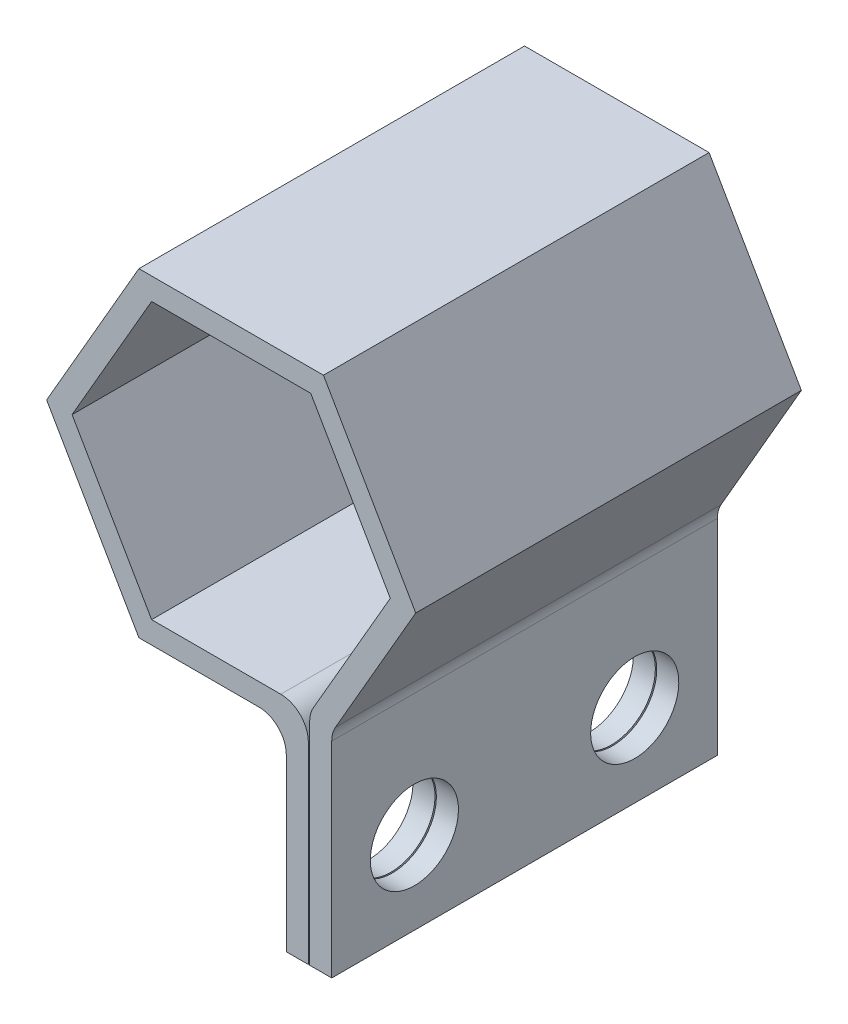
ISO-10303-21;
HEADER;
FILE_DESCRIPTION(('STEP AP214'),'2;1');
FILE_NAME('part.step','',(''),(''),'','','');
FILE_SCHEMA(('AUTOMOTIVE_DESIGN { 1 0 10303 214 1 1 1 1 }'));
ENDSEC;
DATA;
#1=APPLICATION_CONTEXT('core data for automotive mechanical design processes');
#2=APPLICATION_PROTOCOL_DEFINITION('international standard','automotive_design',2000,#1);
#3=PRODUCT_CONTEXT('',#1,'mechanical');
#4=PRODUCT('Part','Part','',(#3));
#5=PRODUCT_RELATED_PRODUCT_CATEGORY('part','',(#4));
#6=PRODUCT_DEFINITION_FORMATION('','',#4);
#7=PRODUCT_DEFINITION_CONTEXT('part definition',#1,'design');
#8=PRODUCT_DEFINITION('design','',#6,#7);
#9=PRODUCT_DEFINITION_SHAPE('','',#8);
#10=(LENGTH_UNIT() NAMED_UNIT(*) SI_UNIT(.MILLI.,.METRE.));
#11=(NAMED_UNIT(*) PLANE_ANGLE_UNIT() SI_UNIT($,.RADIAN.));
#12=(NAMED_UNIT(*) SI_UNIT($,.STERADIAN.) SOLID_ANGLE_UNIT());
#13=UNCERTAINTY_MEASURE_WITH_UNIT(LENGTH_MEASURE(1.E-05),#10,'distance_accuracy_value','');
#14=(GEOMETRIC_REPRESENTATION_CONTEXT(3) GLOBAL_UNCERTAINTY_ASSIGNED_CONTEXT((#13)) GLOBAL_UNIT_ASSIGNED_CONTEXT((#10,
#11,#12)) REPRESENTATION_CONTEXT('',''));
#15=CARTESIAN_POINT('',(0.,0.,0.));
#16=DIRECTION('',(0.,0.,1.));
#17=DIRECTION('',(1.,0.,0.));
#18=AXIS2_PLACEMENT_3D('',#15,#16,#17);
#19=CARTESIAN_POINT('',(2.88811978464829,5.00237020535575,14.));
#20=DIRECTION('',(0.,1.,0.));
#21=DIRECTION('',(0.,0.,1.));
#22=AXIS2_PLACEMENT_3D('',#19,#20,#21);
#23=PLANE('',#22);
#24=DIRECTION('',(1.,0.,0.));
#25=VECTOR('',#24,1.);
#26=CARTESIAN_POINT('',(2.88811978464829,5.00237020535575,0.));
#27=LINE('',#26,#25);
#28=CARTESIAN_POINT('',(-2.88811978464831,5.00237020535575,0.));
#29=VERTEX_POINT('',#28);
#30=CARTESIAN_POINT('',(2.88811978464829,5.00237020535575,0.));
#31=VERTEX_POINT('',#30);
#32=EDGE_CURVE('E225',#29,#31,#27,.T.);
#33=ORIENTED_EDGE('',*,*,#32,.T.);
#34=DIRECTION('',(0.,0.,-1.));
#35=VECTOR('',#34,1.);
#36=CARTESIAN_POINT('',(2.88811978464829,5.00237020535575,14.));
#37=LINE('',#36,#35);
#38=CARTESIAN_POINT('',(2.88811978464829,5.00237020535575,14.));
#39=VERTEX_POINT('',#38);
#40=EDGE_CURVE('E11',#39,#31,#37,.T.);
#41=ORIENTED_EDGE('',*,*,#40,.F.);
#42=DIRECTION('',(1.,0.,0.));
#43=VECTOR('',#42,1.);
#44=CARTESIAN_POINT('',(2.88811978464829,5.00237020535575,14.));
#45=LINE('',#44,#43);
#46=CARTESIAN_POINT('',(-2.88811978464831,5.00237020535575,14.));
#47=VERTEX_POINT('',#46);
#48=EDGE_CURVE('E290',#47,#39,#45,.T.);
#49=ORIENTED_EDGE('',*,*,#48,.F.);
#50=DIRECTION('',(0.,0.,-1.));
#51=VECTOR('',#50,1.);
#52=CARTESIAN_POINT('',(-2.88811978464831,5.00237020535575,14.));
#53=LINE('',#52,#51);
#54=EDGE_CURVE('E221',#47,#29,#53,.T.);
#55=ORIENTED_EDGE('',*,*,#54,.T.);
#56=EDGE_LOOP('',(#33,#41,#49,#55));
#57=FACE_BOUND('',#56,.T.);
#58=ADVANCED_FACE('F36',(#57),#23,.F.);
#59=CARTESIAN_POINT('',(5.77623956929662,0.,14.));
#60=DIRECTION('',(0.866025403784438,0.5,0.));
#61=DIRECTION('',(-0.5,0.866025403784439,0.));
#62=AXIS2_PLACEMENT_3D('',#59,#60,#61);
#63=PLANE('',#62);
#64=DIRECTION('',(0.5,-0.866025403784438,0.));
#65=VECTOR('',#64,1.);
#66=CARTESIAN_POINT('',(5.77623956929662,0.,0.));
#67=LINE('',#66,#65);
#68=CARTESIAN_POINT('',(5.77623956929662,0.,0.));
#69=VERTEX_POINT('',#68);
#70=EDGE_CURVE('E229',#31,#69,#67,.T.);
#71=ORIENTED_EDGE('',*,*,#70,.T.);
#72=DIRECTION('',(0.,0.,-1.));
#73=VECTOR('',#72,1.);
#74=CARTESIAN_POINT('',(5.77623956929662,0.,14.));
#75=LINE('',#74,#73);
#76=CARTESIAN_POINT('',(5.77623956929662,0.,14.));
#77=VERTEX_POINT('',#76);
#78=EDGE_CURVE('E46',#77,#69,#75,.T.);
#79=ORIENTED_EDGE('',*,*,#78,.F.);
#80=DIRECTION('',(0.5,-0.866025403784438,0.));
#81=VECTOR('',#80,1.);
#82=CARTESIAN_POINT('',(5.77623956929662,0.,14.));
#83=LINE('',#82,#81);
#84=EDGE_CURVE('E140',#39,#77,#83,.T.);
#85=ORIENTED_EDGE('',*,*,#84,.F.);
#86=ORIENTED_EDGE('',*,*,#40,.T.);
#87=EDGE_LOOP('',(#71,#79,#85,#86));
#88=FACE_BOUND('',#87,.T.);
#89=ADVANCED_FACE('F465',(#88),#63,.F.);
#90=CARTESIAN_POINT('',(2.98397459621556,-4.83634480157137,14.));
#91=DIRECTION('',(0.866025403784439,-0.5,0.));
#92=DIRECTION('',(0.5,0.866025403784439,0.));
#93=AXIS2_PLACEMENT_3D('',#90,#91,#92);
#94=PLANE('',#93);
#95=DIRECTION('',(-0.5,-0.866025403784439,0.));
#96=VECTOR('',#95,1.);
#97=CARTESIAN_POINT('',(2.98397459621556,-4.83634480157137,0.));
#98=LINE('',#97,#96);
#99=CARTESIAN_POINT('',(2.98397459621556,-4.83634480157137,0.));
#100=VERTEX_POINT('',#99);
#101=EDGE_CURVE('E233',#69,#100,#98,.T.);
#102=ORIENTED_EDGE('',*,*,#101,.T.);
#103=DIRECTION('',(0.,0.,-1.));
#104=VECTOR('',#103,1.);
#105=CARTESIAN_POINT('',(2.98397459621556,-4.83634480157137,14.));
#106=LINE('',#105,#104);
#107=CARTESIAN_POINT('',(2.98397459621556,-4.83634480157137,14.));
#108=VERTEX_POINT('',#107);
#109=EDGE_CURVE('E356',#108,#100,#106,.T.);
#110=ORIENTED_EDGE('',*,*,#109,.F.);
#111=DIRECTION('',(-0.5,-0.866025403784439,0.));
#112=VECTOR('',#111,1.);
#113=CARTESIAN_POINT('',(2.98397459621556,-4.83634480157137,14.));
#114=LINE('',#113,#112);
#115=EDGE_CURVE('E388',#77,#108,#114,.T.);
#116=ORIENTED_EDGE('',*,*,#115,.F.);
#117=ORIENTED_EDGE('',*,*,#78,.T.);
#118=EDGE_LOOP('',(#102,#110,#116,#117));
#119=FACE_BOUND('',#118,.T.);
#120=ADVANCED_FACE('F470',(#119),#94,.F.);
#121=CARTESIAN_POINT('',(3.85,-5.33634480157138,14.));
#122=DIRECTION('',(0.,0.,-1.));
#123=DIRECTION('',(-1.,0.,0.));
#124=AXIS2_PLACEMENT_3D('',#121,#122,#123);
#125=CYLINDRICAL_SURFACE('',#124,1.);
#126=CARTESIAN_POINT('',(3.85,-5.33634480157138,0.));
#127=DIRECTION('',(0.,0.,1.));
#128=DIRECTION('',(1.,0.,0.));
#129=AXIS2_PLACEMENT_3D('',#126,#127,#128);
#130=CIRCLE('',#129,1.);
#131=CARTESIAN_POINT('',(2.85,-5.33634480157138,0.));
#132=VERTEX_POINT('',#131);
#133=EDGE_CURVE('E236',#100,#132,#130,.T.);
#134=ORIENTED_EDGE('',*,*,#133,.T.);
#135=DIRECTION('',(0.,0.,-1.));
#136=VECTOR('',#135,1.);
#137=CARTESIAN_POINT('',(2.85,-5.33634480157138,14.));
#138=LINE('',#137,#136);
#139=CARTESIAN_POINT('',(2.85,-5.33634480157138,14.));
#140=VERTEX_POINT('',#139);
#141=EDGE_CURVE('E352',#140,#132,#138,.T.);
#142=ORIENTED_EDGE('',*,*,#141,.F.);
#143=CARTESIAN_POINT('',(3.85,-5.33634480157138,14.));
#144=DIRECTION('',(0.,0.,1.));
#145=DIRECTION('',(1.,0.,0.));
#146=AXIS2_PLACEMENT_3D('',#143,#144,#145);
#147=CIRCLE('',#146,1.);
#148=EDGE_CURVE('E390',#108,#140,#147,.T.);
#149=ORIENTED_EDGE('',*,*,#148,.F.);
#150=ORIENTED_EDGE('',*,*,#109,.T.);
#151=EDGE_LOOP('',(#134,#142,#149,#150));
#152=FACE_BOUND('',#151,.T.);
#153=ADVANCED_FACE('F486',(#152),#125,.T.);
#154=CARTESIAN_POINT('',(2.85,-5.33634480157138,14.));
#155=DIRECTION('',(1.,0.,0.));
#156=DIRECTION('',(0.,0.,-1.));
#157=AXIS2_PLACEMENT_3D('',#154,#155,#156);
#158=PLANE('',#157);
#159=CARTESIAN_POINT('',(2.85,-10.,3.));
#160=DIRECTION('',(1.,0.,0.));
#161=DIRECTION('',(0.,0.,-1.));
#162=AXIS2_PLACEMENT_3D('',#159,#160,#161);
#163=CIRCLE('',#162,1.6);
#164=CARTESIAN_POINT('',(2.85,-10.,1.4));
#165=VERTEX_POINT('',#164);
#166=EDGE_CURVE('E380',#165,#165,#163,.T.);
#167=ORIENTED_EDGE('',*,*,#166,.T.);
#168=EDGE_LOOP('',(#167));
#169=FACE_BOUND('',#168,.T.);
#170=CARTESIAN_POINT('',(2.85,-10.,11.));
#171=DIRECTION('',(1.,0.,0.));
#172=DIRECTION('',(0.,0.,-1.));
#173=AXIS2_PLACEMENT_3D('',#170,#171,#172);
#174=CIRCLE('',#173,1.6);
#175=CARTESIAN_POINT('',(2.85,-10.,9.4));
#176=VERTEX_POINT('',#175);
#177=EDGE_CURVE('E230',#176,#176,#174,.T.);
#178=ORIENTED_EDGE('',*,*,#177,.T.);
#179=EDGE_LOOP('',(#178));
#180=FACE_BOUND('',#179,.T.);
#181=DIRECTION('',(0.,-1.,0.));
#182=VECTOR('',#181,1.);
#183=CARTESIAN_POINT('',(2.85,-5.33634480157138,0.));
#184=LINE('',#183,#182);
#185=CARTESIAN_POINT('',(2.85,-13.,0.));
#186=VERTEX_POINT('',#185);
#187=EDGE_CURVE('E239',#132,#186,#184,.T.);
#188=ORIENTED_EDGE('',*,*,#187,.T.);
#189=DIRECTION('',(0.,0.,-1.));
#190=VECTOR('',#189,1.);
#191=CARTESIAN_POINT('',(2.85,-13.,14.));
#192=LINE('',#191,#190);
#193=CARTESIAN_POINT('',(2.85,-13.,14.));
#194=VERTEX_POINT('',#193);
#195=EDGE_CURVE('E348',#194,#186,#192,.T.);
#196=ORIENTED_EDGE('',*,*,#195,.F.);
#197=DIRECTION('',(0.,-1.,0.));
#198=VECTOR('',#197,1.);
#199=CARTESIAN_POINT('',(2.85,-5.33634480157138,14.));
#200=LINE('',#199,#198);
#201=EDGE_CURVE('E393',#140,#194,#200,.T.);
#202=ORIENTED_EDGE('',*,*,#201,.F.);
#203=ORIENTED_EDGE('',*,*,#141,.T.);
#204=EDGE_LOOP('',(#188,#196,#202,#203));
#205=FACE_BOUND('',#204,.T.);
#206=ADVANCED_FACE('F489',(#169,#180,#205),#158,.F.);
#207=CARTESIAN_POINT('',(3.65,-13.,14.));
#208=DIRECTION('',(0.,1.,0.));
#209=DIRECTION('',(-1.,0.,0.));
#210=AXIS2_PLACEMENT_3D('',#207,#208,#209);
#211=PLANE('',#210);
#212=DIRECTION('',(1.,0.,0.));
#213=VECTOR('',#212,1.);
#214=CARTESIAN_POINT('',(3.65,-13.,0.));
#215=LINE('',#214,#213);
#216=CARTESIAN_POINT('',(3.65,-13.,0.));
#217=VERTEX_POINT('',#216);
#218=EDGE_CURVE('E242',#186,#217,#215,.T.);
#219=ORIENTED_EDGE('',*,*,#218,.T.);
#220=DIRECTION('',(0.,0.,-1.));
#221=VECTOR('',#220,1.);
#222=CARTESIAN_POINT('',(3.65,-13.,14.));
#223=LINE('',#222,#221);
#224=CARTESIAN_POINT('',(3.65,-13.,14.));
#225=VERTEX_POINT('',#224);
#226=EDGE_CURVE('E344',#225,#217,#223,.T.);
#227=ORIENTED_EDGE('',*,*,#226,.F.);
#228=DIRECTION('',(1.,0.,0.));
#229=VECTOR('',#228,1.);
#230=CARTESIAN_POINT('',(3.65,-13.,14.));
#231=LINE('',#230,#229);
#232=EDGE_CURVE('E396',#194,#225,#231,.T.);
#233=ORIENTED_EDGE('',*,*,#232,.F.);
#234=ORIENTED_EDGE('',*,*,#195,.T.);
#235=EDGE_LOOP('',(#219,#227,#233,#234));
#236=FACE_BOUND('',#235,.T.);
#237=ADVANCED_FACE('F494',(#236),#211,.F.);
#238=CARTESIAN_POINT('',(3.65,-5.55070415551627,14.));
#239=DIRECTION('',(-1.,0.,0.));
#240=DIRECTION('',(0.,-1.,0.));
#241=AXIS2_PLACEMENT_3D('',#238,#239,#240);
#242=PLANE('',#241);
#243=CARTESIAN_POINT('',(3.65,-10.,3.));
#244=DIRECTION('',(1.,0.,0.));
#245=DIRECTION('',(0.,1.,0.));
#246=AXIS2_PLACEMENT_3D('',#243,#244,#245);
#247=CIRCLE('',#246,1.6);
#248=CARTESIAN_POINT('',(3.65,-8.4,3.));
#249=VERTEX_POINT('',#248);
#250=EDGE_CURVE('E439',#249,#249,#247,.T.);
#251=ORIENTED_EDGE('',*,*,#250,.F.);
#252=EDGE_LOOP('',(#251));
#253=FACE_BOUND('',#252,.T.);
#254=CARTESIAN_POINT('',(3.65,-10.,11.));
#255=DIRECTION('',(1.,0.,0.));
#256=DIRECTION('',(0.,1.,0.));
#257=AXIS2_PLACEMENT_3D('',#254,#255,#256);
#258=CIRCLE('',#257,1.6);
#259=CARTESIAN_POINT('',(3.65,-8.4,11.));
#260=VERTEX_POINT('',#259);
#261=EDGE_CURVE('E373',#260,#260,#258,.T.);
#262=ORIENTED_EDGE('',*,*,#261,.F.);
#263=EDGE_LOOP('',(#262));
#264=FACE_BOUND('',#263,.T.);
#265=DIRECTION('',(0.,1.,0.));
#266=VECTOR('',#265,1.);
#267=CARTESIAN_POINT('',(3.65,-5.55070415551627,0.));
#268=LINE('',#267,#266);
#269=CARTESIAN_POINT('',(3.65,-5.55070415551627,0.));
#270=VERTEX_POINT('',#269);
#271=EDGE_CURVE('E245',#217,#270,#268,.T.);
#272=ORIENTED_EDGE('',*,*,#271,.T.);
#273=DIRECTION('',(0.,0.,-1.));
#274=VECTOR('',#273,1.);
#275=CARTESIAN_POINT('',(3.65,-5.55070415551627,14.));
#276=LINE('',#275,#274);
#277=CARTESIAN_POINT('',(3.65,-5.55070415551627,14.));
#278=VERTEX_POINT('',#277);
#279=EDGE_CURVE('E340',#278,#270,#276,.T.);
#280=ORIENTED_EDGE('',*,*,#279,.F.);
#281=DIRECTION('',(0.,1.,0.));
#282=VECTOR('',#281,1.);
#283=CARTESIAN_POINT('',(3.65,-5.55070415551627,14.));
#284=LINE('',#283,#282);
#285=EDGE_CURVE('E399',#225,#278,#284,.T.);
#286=ORIENTED_EDGE('',*,*,#285,.F.);
#287=ORIENTED_EDGE('',*,*,#226,.T.);
#288=EDGE_LOOP('',(#272,#280,#286,#287));
#289=FACE_BOUND('',#288,.T.);
#290=ADVANCED_FACE('F500',(#253,#264,#289),#242,.F.);
#291=CARTESIAN_POINT('',(4.65,-5.55070415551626,14.));
#292=DIRECTION('',(0.,0.,-1.));
#293=DIRECTION('',(-1.,0.,0.));
#294=AXIS2_PLACEMENT_3D('',#291,#292,#293);
#295=CYLINDRICAL_SURFACE('',#294,1.);
#296=CARTESIAN_POINT('',(4.65,-5.55070415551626,0.));
#297=DIRECTION('',(0.,0.,-1.));
#298=DIRECTION('',(1.,0.,0.));
#299=AXIS2_PLACEMENT_3D('',#296,#297,#298);
#300=CIRCLE('',#299,1.);
#301=CARTESIAN_POINT('',(3.78397459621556,-5.05070415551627,0.));
#302=VERTEX_POINT('',#301);
#303=EDGE_CURVE('E248',#270,#302,#300,.T.);
#304=ORIENTED_EDGE('',*,*,#303,.T.);
#305=DIRECTION('',(0.,0.,-1.));
#306=VECTOR('',#305,1.);
#307=CARTESIAN_POINT('',(3.78397459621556,-5.05070415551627,14.));
#308=LINE('',#307,#306);
#309=CARTESIAN_POINT('',(3.78397459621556,-5.05070415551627,14.));
#310=VERTEX_POINT('',#309);
#311=EDGE_CURVE('E336',#310,#302,#308,.T.);
#312=ORIENTED_EDGE('',*,*,#311,.F.);
#313=CARTESIAN_POINT('',(4.65,-5.55070415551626,14.));
#314=DIRECTION('',(0.,0.,-1.));
#315=DIRECTION('',(1.,0.,0.));
#316=AXIS2_PLACEMENT_3D('',#313,#314,#315);
#317=CIRCLE('',#316,1.);
#318=EDGE_CURVE('E402',#278,#310,#317,.T.);
#319=ORIENTED_EDGE('',*,*,#318,.F.);
#320=ORIENTED_EDGE('',*,*,#279,.T.);
#321=EDGE_LOOP('',(#304,#312,#319,#320));
#322=FACE_BOUND('',#321,.T.);
#323=ADVANCED_FACE('F504',(#322),#295,.F.);
#324=CARTESIAN_POINT('',(3.78397459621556,-5.05070415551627,14.));
#325=DIRECTION('',(-0.866025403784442,0.499999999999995,0.));
#326=DIRECTION('',(-0.499999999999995,-0.866025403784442,0.));
#327=AXIS2_PLACEMENT_3D('',#324,#325,#326);
#328=PLANE('',#327);
#329=DIRECTION('',(0.499999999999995,0.866025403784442,0.));
#330=VECTOR('',#329,1.);
#331=CARTESIAN_POINT('',(3.78397459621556,-5.05070415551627,0.));
#332=LINE('',#331,#330);
#333=CARTESIAN_POINT('',(6.7,0.,0.));
#334=VERTEX_POINT('',#333);
#335=EDGE_CURVE('E251',#302,#334,#332,.T.);
#336=ORIENTED_EDGE('',*,*,#335,.T.);
#337=DIRECTION('',(0.,0.,-1.));
#338=VECTOR('',#337,1.);
#339=CARTESIAN_POINT('',(6.7,0.,14.));
#340=LINE('',#339,#338);
#341=CARTESIAN_POINT('',(6.7,0.,14.));
#342=VERTEX_POINT('',#341);
#343=EDGE_CURVE('E333',#342,#334,#340,.T.);
#344=ORIENTED_EDGE('',*,*,#343,.F.);
#345=DIRECTION('',(0.499999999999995,0.866025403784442,0.));
#346=VECTOR('',#345,1.);
#347=CARTESIAN_POINT('',(3.78397459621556,-5.05070415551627,14.));
#348=LINE('',#347,#346);
#349=EDGE_CURVE('E405',#310,#342,#348,.T.);
#350=ORIENTED_EDGE('',*,*,#349,.F.);
#351=ORIENTED_EDGE('',*,*,#311,.T.);
#352=EDGE_LOOP('',(#336,#344,#350,#351));
#353=FACE_BOUND('',#352,.T.);
#354=ADVANCED_FACE('F509',(#353),#328,.F.);
#355=CARTESIAN_POINT('',(6.7,0.,14.));
#356=DIRECTION('',(-0.866025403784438,-0.500000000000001,0.));
#357=DIRECTION('',(0.500000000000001,-0.866025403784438,0.));
#358=AXIS2_PLACEMENT_3D('',#355,#356,#357);
#359=PLANE('',#358);
#360=DIRECTION('',(-0.500000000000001,0.866025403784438,0.));
#361=VECTOR('',#360,1.);
#362=CARTESIAN_POINT('',(6.7,0.,0.));
#363=LINE('',#362,#361);
#364=CARTESIAN_POINT('',(3.34999999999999,5.80237020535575,0.));
#365=VERTEX_POINT('',#364);
#366=EDGE_CURVE('E254',#334,#365,#363,.T.);
#367=ORIENTED_EDGE('',*,*,#366,.T.);
#368=DIRECTION('',(0.,0.,-1.));
#369=VECTOR('',#368,1.);
#370=CARTESIAN_POINT('',(3.34999999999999,5.80237020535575,14.));
#371=LINE('',#370,#369);
#372=CARTESIAN_POINT('',(3.34999999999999,5.80237020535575,14.));
#373=VERTEX_POINT('',#372);
#374=EDGE_CURVE('E329',#373,#365,#371,.T.);
#375=ORIENTED_EDGE('',*,*,#374,.F.);
#376=DIRECTION('',(-0.500000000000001,0.866025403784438,0.));
#377=VECTOR('',#376,1.);
#378=CARTESIAN_POINT('',(6.7,0.,14.));
#379=LINE('',#378,#377);
#380=EDGE_CURVE('E408',#342,#373,#379,.T.);
#381=ORIENTED_EDGE('',*,*,#380,.F.);
#382=ORIENTED_EDGE('',*,*,#343,.T.);
#383=EDGE_LOOP('',(#367,#375,#381,#382));
#384=FACE_BOUND('',#383,.T.);
#385=ADVANCED_FACE('F515',(#384),#359,.F.);
#386=CARTESIAN_POINT('',(3.34999999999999,5.80237020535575,14.));
#387=DIRECTION('',(0.,-1.,0.));
#388=DIRECTION('',(1.,0.,0.));
#389=AXIS2_PLACEMENT_3D('',#386,#387,#388);
#390=PLANE('',#389);
#391=DIRECTION('',(-1.,0.,0.));
#392=VECTOR('',#391,1.);
#393=CARTESIAN_POINT('',(3.34999999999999,5.80237020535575,0.));
#394=LINE('',#393,#392);
#395=CARTESIAN_POINT('',(-3.35000000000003,5.80237020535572,0.));
#396=VERTEX_POINT('',#395);
#397=EDGE_CURVE('E257',#365,#396,#394,.T.);
#398=ORIENTED_EDGE('',*,*,#397,.T.);
#399=DIRECTION('',(0.,0.,-1.));
#400=VECTOR('',#399,1.);
#401=CARTESIAN_POINT('',(-3.35000000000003,5.80237020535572,14.));
#402=LINE('',#401,#400);
#403=CARTESIAN_POINT('',(-3.35000000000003,5.80237020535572,14.));
#404=VERTEX_POINT('',#403);
#405=EDGE_CURVE('E325',#404,#396,#402,.T.);
#406=ORIENTED_EDGE('',*,*,#405,.F.);
#407=DIRECTION('',(-1.,0.,0.));
#408=VECTOR('',#407,1.);
#409=CARTESIAN_POINT('',(3.34999999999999,5.80237020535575,14.));
#410=LINE('',#409,#408);
#411=EDGE_CURVE('E410',#373,#404,#410,.T.);
#412=ORIENTED_EDGE('',*,*,#411,.F.);
#413=ORIENTED_EDGE('',*,*,#374,.T.);
#414=EDGE_LOOP('',(#398,#406,#412,#413));
#415=FACE_BOUND('',#414,.T.);
#416=ADVANCED_FACE('F519',(#415),#390,.F.);
#417=CARTESIAN_POINT('',(-3.35000000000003,5.80237020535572,14.));
#418=DIRECTION('',(0.866025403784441,-0.499999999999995,0.));
#419=DIRECTION('',(0.499999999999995,0.866025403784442,0.));
#420=AXIS2_PLACEMENT_3D('',#417,#418,#419);
#421=PLANE('',#420);
#422=DIRECTION('',(-0.499999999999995,-0.866025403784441,0.));
#423=VECTOR('',#422,1.);
#424=CARTESIAN_POINT('',(-3.35000000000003,5.80237020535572,0.));
#425=LINE('',#424,#423);
#426=CARTESIAN_POINT('',(-6.7,0.,0.));
#427=VERTEX_POINT('',#426);
#428=EDGE_CURVE('E260',#396,#427,#425,.T.);
#429=ORIENTED_EDGE('',*,*,#428,.T.);
#430=DIRECTION('',(0.,0.,-1.));
#431=VECTOR('',#430,1.);
#432=CARTESIAN_POINT('',(-6.7,0.,14.));
#433=LINE('',#432,#431);
#434=CARTESIAN_POINT('',(-6.7,0.,14.));
#435=VERTEX_POINT('',#434);
#436=EDGE_CURVE('E321',#435,#427,#433,.T.);
#437=ORIENTED_EDGE('',*,*,#436,.F.);
#438=DIRECTION('',(-0.499999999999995,-0.866025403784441,0.));
#439=VECTOR('',#438,1.);
#440=CARTESIAN_POINT('',(-3.35000000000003,5.80237020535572,14.));
#441=LINE('',#440,#439);
#442=EDGE_CURVE('E413',#404,#435,#441,.T.);
#443=ORIENTED_EDGE('',*,*,#442,.F.);
#444=ORIENTED_EDGE('',*,*,#405,.T.);
#445=EDGE_LOOP('',(#429,#437,#443,#444));
#446=FACE_BOUND('',#445,.T.);
#447=ADVANCED_FACE('F524',(#446),#421,.F.);
#448=CARTESIAN_POINT('',(-6.7,0.,14.));
#449=DIRECTION('',(0.866025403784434,0.500000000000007,0.));
#450=DIRECTION('',(-0.500000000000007,0.866025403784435,0.));
#451=AXIS2_PLACEMENT_3D('',#448,#449,#450);
#452=PLANE('',#451);
#453=DIRECTION('',(0.500000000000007,-0.866025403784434,0.));
#454=VECTOR('',#453,1.);
#455=CARTESIAN_POINT('',(-6.7,0.,0.));
#456=LINE('',#455,#454);
#457=CARTESIAN_POINT('',(-3.34999999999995,-5.80237020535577,0.));
#458=VERTEX_POINT('',#457);
#459=EDGE_CURVE('E263',#427,#458,#456,.T.);
#460=ORIENTED_EDGE('',*,*,#459,.T.);
#461=DIRECTION('',(0.,0.,-1.));
#462=VECTOR('',#461,1.);
#463=CARTESIAN_POINT('',(-3.34999999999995,-5.80237020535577,14.));
#464=LINE('',#463,#462);
#465=CARTESIAN_POINT('',(-3.34999999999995,-5.80237020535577,14.));
#466=VERTEX_POINT('',#465);
#467=EDGE_CURVE('E317',#466,#458,#464,.T.);
#468=ORIENTED_EDGE('',*,*,#467,.F.);
#469=DIRECTION('',(0.500000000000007,-0.866025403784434,0.));
#470=VECTOR('',#469,1.);
#471=CARTESIAN_POINT('',(-6.7,0.,14.));
#472=LINE('',#471,#470);
#473=EDGE_CURVE('E416',#435,#466,#472,.T.);
#474=ORIENTED_EDGE('',*,*,#473,.F.);
#475=ORIENTED_EDGE('',*,*,#436,.T.);
#476=EDGE_LOOP('',(#460,#468,#474,#475));
#477=FACE_BOUND('',#476,.T.);
#478=ADVANCED_FACE('F530',(#477),#452,.F.);
#479=CARTESIAN_POINT('',(-3.34999999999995,-5.80237020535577,14.));
#480=DIRECTION('',(0.,1.,0.));
#481=DIRECTION('',(-1.,0.,0.));
#482=AXIS2_PLACEMENT_3D('',#479,#480,#481);
#483=PLANE('',#482);
#484=DIRECTION('',(1.,0.,0.));
#485=VECTOR('',#484,1.);
#486=CARTESIAN_POINT('',(-3.34999999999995,-5.80237020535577,0.));
#487=LINE('',#486,#485);
#488=CARTESIAN_POINT('',(0.999999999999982,-5.80237020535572,0.));
#489=VERTEX_POINT('',#488);
#490=EDGE_CURVE('E266',#458,#489,#487,.T.);
#491=ORIENTED_EDGE('',*,*,#490,.T.);
#492=DIRECTION('',(0.,0.,-1.));
#493=VECTOR('',#492,1.);
#494=CARTESIAN_POINT('',(0.999999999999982,-5.80237020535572,14.));
#495=LINE('',#494,#493);
#496=CARTESIAN_POINT('',(0.999999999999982,-5.80237020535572,14.));
#497=VERTEX_POINT('',#496);
#498=EDGE_CURVE('E313',#497,#489,#495,.T.);
#499=ORIENTED_EDGE('',*,*,#498,.F.);
#500=DIRECTION('',(1.,0.,0.));
#501=VECTOR('',#500,1.);
#502=CARTESIAN_POINT('',(-3.34999999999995,-5.80237020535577,14.));
#503=LINE('',#502,#501);
#504=EDGE_CURVE('E419',#466,#497,#503,.T.);
#505=ORIENTED_EDGE('',*,*,#504,.F.);
#506=ORIENTED_EDGE('',*,*,#467,.T.);
#507=EDGE_LOOP('',(#491,#499,#505,#506));
#508=FACE_BOUND('',#507,.T.);
#509=ADVANCED_FACE('F534',(#508),#483,.F.);
#510=CARTESIAN_POINT('',(0.999999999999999,-6.80237020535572,14.));
#511=DIRECTION('',(0.,0.,-1.));
#512=DIRECTION('',(-1.,0.,0.));
#513=AXIS2_PLACEMENT_3D('',#510,#511,#512);
#514=CYLINDRICAL_SURFACE('',#513,1.);
#515=CARTESIAN_POINT('',(0.999999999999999,-6.80237020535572,0.));
#516=DIRECTION('',(0.,0.,-1.));
#517=DIRECTION('',(-1.,0.,0.));
#518=AXIS2_PLACEMENT_3D('',#515,#516,#517);
#519=CIRCLE('',#518,1.);
#520=CARTESIAN_POINT('',(2.,-6.80237020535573,0.));
#521=VERTEX_POINT('',#520);
#522=EDGE_CURVE('E269',#489,#521,#519,.T.);
#523=ORIENTED_EDGE('',*,*,#522,.T.);
#524=DIRECTION('',(0.,0.,-1.));
#525=VECTOR('',#524,1.);
#526=CARTESIAN_POINT('',(2.,-6.80237020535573,14.));
#527=LINE('',#526,#525);
#528=CARTESIAN_POINT('',(2.,-6.80237020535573,14.));
#529=VERTEX_POINT('',#528);
#530=EDGE_CURVE('E309',#529,#521,#527,.T.);
#531=ORIENTED_EDGE('',*,*,#530,.F.);
#532=CARTESIAN_POINT('',(0.999999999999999,-6.80237020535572,14.));
#533=DIRECTION('',(0.,0.,-1.));
#534=DIRECTION('',(-1.,0.,0.));
#535=AXIS2_PLACEMENT_3D('',#532,#533,#534);
#536=CIRCLE('',#535,1.);
#537=EDGE_CURVE('E422',#497,#529,#536,.T.);
#538=ORIENTED_EDGE('',*,*,#537,.F.);
#539=ORIENTED_EDGE('',*,*,#498,.T.);
#540=EDGE_LOOP('',(#523,#531,#538,#539));
#541=FACE_BOUND('',#540,.T.);
#542=ADVANCED_FACE('F539',(#541),#514,.F.);
#543=CARTESIAN_POINT('',(2.,-6.80237020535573,14.));
#544=DIRECTION('',(1.,0.,0.));
#545=DIRECTION('',(0.,1.,0.));
#546=AXIS2_PLACEMENT_3D('',#543,#544,#545);
#547=PLANE('',#546);
#548=CARTESIAN_POINT('',(2.,-10.,3.));
#549=DIRECTION('',(1.,0.,0.));
#550=DIRECTION('',(0.,1.,0.));
#551=AXIS2_PLACEMENT_3D('',#548,#549,#550);
#552=CIRCLE('',#551,1.6);
#553=CARTESIAN_POINT('',(2.,-8.4,3.));
#554=VERTEX_POINT('',#553);
#555=EDGE_CURVE('E437',#554,#554,#552,.F.);
#556=ORIENTED_EDGE('',*,*,#555,.F.);
#557=EDGE_LOOP('',(#556));
#558=FACE_BOUND('',#557,.T.);
#559=CARTESIAN_POINT('',(2.,-10.,11.));
#560=DIRECTION('',(1.,0.,0.));
#561=DIRECTION('',(0.,1.,0.));
#562=AXIS2_PLACEMENT_3D('',#559,#560,#561);
#563=CIRCLE('',#562,1.6);
#564=CARTESIAN_POINT('',(2.,-8.4,11.));
#565=VERTEX_POINT('',#564);
#566=EDGE_CURVE('E365',#565,#565,#563,.F.);
#567=ORIENTED_EDGE('',*,*,#566,.F.);
#568=EDGE_LOOP('',(#567));
#569=FACE_BOUND('',#568,.T.);
#570=DIRECTION('',(0.,-1.,0.));
#571=VECTOR('',#570,1.);
#572=CARTESIAN_POINT('',(2.,-6.80237020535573,0.));
#573=LINE('',#572,#571);
#574=CARTESIAN_POINT('',(2.,-13.,0.));
#575=VERTEX_POINT('',#574);
#576=EDGE_CURVE('E272',#521,#575,#573,.T.);
#577=ORIENTED_EDGE('',*,*,#576,.T.);
#578=DIRECTION('',(0.,0.,-1.));
#579=VECTOR('',#578,1.);
#580=CARTESIAN_POINT('',(2.,-13.,14.));
#581=LINE('',#580,#579);
#582=CARTESIAN_POINT('',(2.,-13.,14.));
#583=VERTEX_POINT('',#582);
#584=EDGE_CURVE('E305',#583,#575,#581,.T.);
#585=ORIENTED_EDGE('',*,*,#584,.F.);
#586=DIRECTION('',(0.,-1.,0.));
#587=VECTOR('',#586,1.);
#588=CARTESIAN_POINT('',(2.,-6.80237020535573,14.));
#589=LINE('',#588,#587);
#590=EDGE_CURVE('E425',#529,#583,#589,.T.);
#591=ORIENTED_EDGE('',*,*,#590,.F.);
#592=ORIENTED_EDGE('',*,*,#530,.T.);
#593=EDGE_LOOP('',(#577,#585,#591,#592));
#594=FACE_BOUND('',#593,.T.);
#595=ADVANCED_FACE('F545',(#558,#569,#594),#547,.F.);
#596=CARTESIAN_POINT('',(2.8,-13.,14.));
#597=DIRECTION('',(0.,1.,0.));
#598=DIRECTION('',(0.,0.,1.));
#599=AXIS2_PLACEMENT_3D('',#596,#597,#598);
#600=PLANE('',#599);
#601=DIRECTION('',(1.,0.,0.));
#602=VECTOR('',#601,1.);
#603=CARTESIAN_POINT('',(2.8,-13.,0.));
#604=LINE('',#603,#602);
#605=CARTESIAN_POINT('',(2.8,-13.,0.));
#606=VERTEX_POINT('',#605);
#607=EDGE_CURVE('E275',#575,#606,#604,.T.);
#608=ORIENTED_EDGE('',*,*,#607,.T.);
#609=DIRECTION('',(0.,0.,-1.));
#610=VECTOR('',#609,1.);
#611=CARTESIAN_POINT('',(2.8,-13.,14.));
#612=LINE('',#611,#610);
#613=CARTESIAN_POINT('',(2.8,-13.,14.));
#614=VERTEX_POINT('',#613);
#615=EDGE_CURVE('E301',#614,#606,#612,.T.);
#616=ORIENTED_EDGE('',*,*,#615,.F.);
#617=DIRECTION('',(1.,0.,0.));
#618=VECTOR('',#617,1.);
#619=CARTESIAN_POINT('',(2.8,-13.,14.));
#620=LINE('',#619,#618);
#621=EDGE_CURVE('E428',#583,#614,#620,.T.);
#622=ORIENTED_EDGE('',*,*,#621,.F.);
#623=ORIENTED_EDGE('',*,*,#584,.T.);
#624=EDGE_LOOP('',(#608,#616,#622,#623));
#625=FACE_BOUND('',#624,.T.);
#626=ADVANCED_FACE('F549',(#625),#600,.F.);
#627=CARTESIAN_POINT('',(2.8,-6.00237020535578,14.));
#628=DIRECTION('',(-1.,0.,0.));
#629=DIRECTION('',(0.,-1.,0.));
#630=AXIS2_PLACEMENT_3D('',#627,#628,#629);
#631=PLANE('',#630);
#632=CARTESIAN_POINT('',(2.8,-10.,3.));
#633=DIRECTION('',(-1.,0.,0.));
#634=DIRECTION('',(0.,-1.,0.));
#635=AXIS2_PLACEMENT_3D('',#632,#633,#634);
#636=CIRCLE('',#635,1.6);
#637=CARTESIAN_POINT('',(2.8,-11.6,3.));
#638=VERTEX_POINT('',#637);
#639=EDGE_CURVE('E39',#638,#638,#636,.T.);
#640=ORIENTED_EDGE('',*,*,#639,.T.);
#641=EDGE_LOOP('',(#640));
#642=FACE_BOUND('',#641,.T.);
#643=CARTESIAN_POINT('',(2.8,-10.,11.));
#644=DIRECTION('',(-1.,0.,0.));
#645=DIRECTION('',(0.,-1.,0.));
#646=AXIS2_PLACEMENT_3D('',#643,#644,#645);
#647=CIRCLE('',#646,1.6);
#648=CARTESIAN_POINT('',(2.8,-11.6,11.));
#649=VERTEX_POINT('',#648);
#650=EDGE_CURVE('E362',#649,#649,#647,.T.);
#651=ORIENTED_EDGE('',*,*,#650,.T.);
#652=EDGE_LOOP('',(#651));
#653=FACE_BOUND('',#652,.T.);
#654=DIRECTION('',(0.,1.,0.));
#655=VECTOR('',#654,1.);
#656=CARTESIAN_POINT('',(2.8,-6.00237020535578,0.));
#657=LINE('',#656,#655);
#658=CARTESIAN_POINT('',(2.8,-6.00237020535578,0.));
#659=VERTEX_POINT('',#658);
#660=EDGE_CURVE('E278',#606,#659,#657,.T.);
#661=ORIENTED_EDGE('',*,*,#660,.T.);
#662=DIRECTION('',(0.,0.,-1.));
#663=VECTOR('',#662,1.);
#664=CARTESIAN_POINT('',(2.8,-6.00237020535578,14.));
#665=LINE('',#664,#663);
#666=CARTESIAN_POINT('',(2.8,-6.00237020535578,14.));
#667=VERTEX_POINT('',#666);
#668=EDGE_CURVE('E297',#667,#659,#665,.T.);
#669=ORIENTED_EDGE('',*,*,#668,.F.);
#670=DIRECTION('',(0.,1.,0.));
#671=VECTOR('',#670,1.);
#672=CARTESIAN_POINT('',(2.8,-6.00237020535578,14.));
#673=LINE('',#672,#671);
#674=EDGE_CURVE('E431',#614,#667,#673,.T.);
#675=ORIENTED_EDGE('',*,*,#674,.F.);
#676=ORIENTED_EDGE('',*,*,#615,.T.);
#677=EDGE_LOOP('',(#661,#669,#675,#676));
#678=FACE_BOUND('',#677,.T.);
#679=ADVANCED_FACE('F448',(#642,#653,#678),#631,.F.);
#680=CARTESIAN_POINT('',(1.8,-6.00237020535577,14.));
#681=DIRECTION('',(0.,0.,-1.));
#682=DIRECTION('',(-1.,0.,0.));
#683=AXIS2_PLACEMENT_3D('',#680,#681,#682);
#684=CYLINDRICAL_SURFACE('',#683,1.);
#685=CARTESIAN_POINT('',(1.8,-6.00237020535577,0.));
#686=DIRECTION('',(0.,0.,1.));
#687=DIRECTION('',(-1.,0.,0.));
#688=AXIS2_PLACEMENT_3D('',#685,#686,#687);
#689=CIRCLE('',#688,1.);
#690=CARTESIAN_POINT('',(1.79999999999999,-5.00237020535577,0.));
#691=VERTEX_POINT('',#690);
#692=EDGE_CURVE('E281',#659,#691,#689,.T.);
#693=ORIENTED_EDGE('',*,*,#692,.T.);
#694=DIRECTION('',(0.,0.,-1.));
#695=VECTOR('',#694,1.);
#696=CARTESIAN_POINT('',(1.79999999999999,-5.00237020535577,14.));
#697=LINE('',#696,#695);
#698=CARTESIAN_POINT('',(1.79999999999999,-5.00237020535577,14.));
#699=VERTEX_POINT('',#698);
#700=EDGE_CURVE('E212',#699,#691,#697,.T.);
#701=ORIENTED_EDGE('',*,*,#700,.F.);
#702=CARTESIAN_POINT('',(1.8,-6.00237020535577,14.));
#703=DIRECTION('',(0.,0.,1.));
#704=DIRECTION('',(-1.,0.,0.));
#705=AXIS2_PLACEMENT_3D('',#702,#703,#704);
#706=CIRCLE('',#705,1.);
#707=EDGE_CURVE('E201',#667,#699,#706,.T.);
#708=ORIENTED_EDGE('',*,*,#707,.F.);
#709=ORIENTED_EDGE('',*,*,#668,.T.);
#710=EDGE_LOOP('',(#693,#701,#708,#709));
#711=FACE_BOUND('',#710,.T.);
#712=ADVANCED_FACE('F556',(#711),#684,.T.);
#713=CARTESIAN_POINT('',(-2.88811978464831,-5.00237020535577,14.));
#714=DIRECTION('',(0.,-1.,0.));
#715=DIRECTION('',(0.,0.,-1.));
#716=AXIS2_PLACEMENT_3D('',#713,#714,#715);
#717=PLANE('',#716);
#718=DIRECTION('',(-1.,0.,0.));
#719=VECTOR('',#718,1.);
#720=CARTESIAN_POINT('',(-2.88811978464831,-5.00237020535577,0.));
#721=LINE('',#720,#719);
#722=CARTESIAN_POINT('',(-2.88811978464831,-5.00237020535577,0.));
#723=VERTEX_POINT('',#722);
#724=EDGE_CURVE('E210',#691,#723,#721,.T.);
#725=ORIENTED_EDGE('',*,*,#724,.T.);
#726=DIRECTION('',(0.,0.,-1.));
#727=VECTOR('',#726,1.);
#728=CARTESIAN_POINT('',(-2.88811978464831,-5.00237020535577,14.));
#729=LINE('',#728,#727);
#730=CARTESIAN_POINT('',(-2.88811978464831,-5.00237020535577,14.));
#731=VERTEX_POINT('',#730);
#732=EDGE_CURVE('E207',#731,#723,#729,.T.);
#733=ORIENTED_EDGE('',*,*,#732,.F.);
#734=DIRECTION('',(-1.,0.,0.));
#735=VECTOR('',#734,1.);
#736=CARTESIAN_POINT('',(-2.88811978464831,-5.00237020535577,14.));
#737=LINE('',#736,#735);
#738=EDGE_CURVE('E195',#699,#731,#737,.T.);
#739=ORIENTED_EDGE('',*,*,#738,.F.);
#740=ORIENTED_EDGE('',*,*,#700,.T.);
#741=EDGE_LOOP('',(#725,#733,#739,#740));
#742=FACE_BOUND('',#741,.T.);
#743=ADVANCED_FACE('F208',(#742),#717,.F.);
#744=CARTESIAN_POINT('',(-5.77623956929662,0.,14.));
#745=DIRECTION('',(-0.866025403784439,-0.5,0.));
#746=DIRECTION('',(0.5,-0.866025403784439,0.));
#747=AXIS2_PLACEMENT_3D('',#744,#745,#746);
#748=PLANE('',#747);
#749=DIRECTION('',(-0.5,0.866025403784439,0.));
#750=VECTOR('',#749,1.);
#751=CARTESIAN_POINT('',(-5.77623956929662,0.,0.));
#752=LINE('',#751,#750);
#753=CARTESIAN_POINT('',(-5.77623956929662,0.,0.));
#754=VERTEX_POINT('',#753);
#755=EDGE_CURVE('E126',#723,#754,#752,.T.);
#756=ORIENTED_EDGE('',*,*,#755,.T.);
#757=DIRECTION('',(0.,0.,-1.));
#758=VECTOR('',#757,1.);
#759=CARTESIAN_POINT('',(-5.77623956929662,0.,14.));
#760=LINE('',#759,#758);
#761=CARTESIAN_POINT('',(-5.77623956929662,0.,14.));
#762=VERTEX_POINT('',#761);
#763=EDGE_CURVE('E213',#762,#754,#760,.T.);
#764=ORIENTED_EDGE('',*,*,#763,.F.);
#765=DIRECTION('',(-0.5,0.866025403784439,0.));
#766=VECTOR('',#765,1.);
#767=CARTESIAN_POINT('',(-5.77623956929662,0.,14.));
#768=LINE('',#767,#766);
#769=EDGE_CURVE('E199',#731,#762,#768,.T.);
#770=ORIENTED_EDGE('',*,*,#769,.F.);
#771=ORIENTED_EDGE('',*,*,#732,.T.);
#772=EDGE_LOOP('',(#756,#764,#770,#771));
#773=FACE_BOUND('',#772,.T.);
#774=ADVANCED_FACE('F215',(#773),#748,.F.);
#775=CARTESIAN_POINT('',(-2.88811978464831,5.00237020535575,14.));
#776=DIRECTION('',(-0.866025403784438,0.5,0.));
#777=DIRECTION('',(-0.5,-0.866025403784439,0.));
#778=AXIS2_PLACEMENT_3D('',#775,#776,#777);
#779=PLANE('',#778);
#780=DIRECTION('',(0.5,0.866025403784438,0.));
#781=VECTOR('',#780,1.);
#782=CARTESIAN_POINT('',(-2.88811978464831,5.00237020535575,0.));
#783=LINE('',#782,#781);
#784=EDGE_CURVE('E132',#754,#29,#783,.T.);
#785=ORIENTED_EDGE('',*,*,#784,.T.);
#786=ORIENTED_EDGE('',*,*,#54,.F.);
#787=DIRECTION('',(0.5,0.866025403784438,0.));
#788=VECTOR('',#787,1.);
#789=CARTESIAN_POINT('',(-2.88811978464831,5.00237020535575,14.));
#790=LINE('',#789,#788);
#791=EDGE_CURVE('E55',#762,#47,#790,.T.);
#792=ORIENTED_EDGE('',*,*,#791,.F.);
#793=ORIENTED_EDGE('',*,*,#763,.T.);
#794=EDGE_LOOP('',(#785,#786,#792,#793));
#795=FACE_BOUND('',#794,.T.);
#796=ADVANCED_FACE('F664',(#795),#779,.F.);
#797=CARTESIAN_POINT('',(1.8,-6.00237020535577,14.));
#798=DIRECTION('',(0.,0.,-1.));
#799=DIRECTION('',(-1.,0.,0.));
#800=AXIS2_PLACEMENT_3D('',#797,#798,#799);
#801=PLANE('',#800);
#802=ORIENTED_EDGE('',*,*,#48,.T.);
#803=ORIENTED_EDGE('',*,*,#84,.T.);
#804=ORIENTED_EDGE('',*,*,#115,.T.);
#805=ORIENTED_EDGE('',*,*,#148,.T.);
#806=ORIENTED_EDGE('',*,*,#201,.T.);
#807=ORIENTED_EDGE('',*,*,#232,.T.);
#808=ORIENTED_EDGE('',*,*,#285,.T.);
#809=ORIENTED_EDGE('',*,*,#318,.T.);
#810=ORIENTED_EDGE('',*,*,#349,.T.);
#811=ORIENTED_EDGE('',*,*,#380,.T.);
#812=ORIENTED_EDGE('',*,*,#411,.T.);
#813=ORIENTED_EDGE('',*,*,#442,.T.);
#814=ORIENTED_EDGE('',*,*,#473,.T.);
#815=ORIENTED_EDGE('',*,*,#504,.T.);
#816=ORIENTED_EDGE('',*,*,#537,.T.);
#817=ORIENTED_EDGE('',*,*,#590,.T.);
#818=ORIENTED_EDGE('',*,*,#621,.T.);
#819=ORIENTED_EDGE('',*,*,#674,.T.);
#820=ORIENTED_EDGE('',*,*,#707,.T.);
#821=ORIENTED_EDGE('',*,*,#738,.T.);
#822=ORIENTED_EDGE('',*,*,#769,.T.);
#823=ORIENTED_EDGE('',*,*,#791,.T.);
#824=EDGE_LOOP('',(#802,#803,#804,#805,#806,#807,#808,#809,#810,#811,#812,#813,#814,#815,#816,
#817,#818,#819,#820,#821,#822,#823));
#825=FACE_BOUND('',#824,.T.);
#826=ADVANCED_FACE('F197',(#825),#801,.F.);
#827=CARTESIAN_POINT('',(1.8,-6.00237020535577,0.));
#828=DIRECTION('',(0.,0.,-1.));
#829=DIRECTION('',(-1.,0.,0.));
#830=AXIS2_PLACEMENT_3D('',#827,#828,#829);
#831=PLANE('',#830);
#832=ORIENTED_EDGE('',*,*,#32,.F.);
#833=ORIENTED_EDGE('',*,*,#784,.F.);
#834=ORIENTED_EDGE('',*,*,#755,.F.);
#835=ORIENTED_EDGE('',*,*,#724,.F.);
#836=ORIENTED_EDGE('',*,*,#692,.F.);
#837=ORIENTED_EDGE('',*,*,#660,.F.);
#838=ORIENTED_EDGE('',*,*,#607,.F.);
#839=ORIENTED_EDGE('',*,*,#576,.F.);
#840=ORIENTED_EDGE('',*,*,#522,.F.);
#841=ORIENTED_EDGE('',*,*,#490,.F.);
#842=ORIENTED_EDGE('',*,*,#459,.F.);
#843=ORIENTED_EDGE('',*,*,#428,.F.);
#844=ORIENTED_EDGE('',*,*,#397,.F.);
#845=ORIENTED_EDGE('',*,*,#366,.F.);
#846=ORIENTED_EDGE('',*,*,#335,.F.);
#847=ORIENTED_EDGE('',*,*,#303,.F.);
#848=ORIENTED_EDGE('',*,*,#271,.F.);
#849=ORIENTED_EDGE('',*,*,#218,.F.);
#850=ORIENTED_EDGE('',*,*,#187,.F.);
#851=ORIENTED_EDGE('',*,*,#133,.F.);
#852=ORIENTED_EDGE('',*,*,#101,.F.);
#853=ORIENTED_EDGE('',*,*,#70,.F.);
#854=EDGE_LOOP('',(#832,#833,#834,#835,#836,#837,#838,#839,#840,#841,#842,#843,#844,#845,#846,
#847,#848,#849,#850,#851,#852,#853));
#855=FACE_BOUND('',#854,.T.);
#856=ADVANCED_FACE('F475',(#855),#831,.T.);
#857=CARTESIAN_POINT('',(-2.52548339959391,-10.,11.));
#858=DIRECTION('',(1.,0.,0.));
#859=DIRECTION('',(0.,1.,0.));
#860=AXIS2_PLACEMENT_3D('',#857,#858,#859);
#861=CYLINDRICAL_SURFACE('',#860,1.6);
#862=ORIENTED_EDGE('',*,*,#566,.T.);
#863=EDGE_LOOP('',(#862));
#864=FACE_BOUND('',#863,.T.);
#865=ORIENTED_EDGE('',*,*,#650,.F.);
#866=EDGE_LOOP('',(#865));
#867=FACE_BOUND('',#866,.T.);
#868=ADVANCED_FACE('F461',(#864,#867),#861,.F.);
#869=ORIENTED_EDGE('',*,*,#261,.T.);
#870=EDGE_LOOP('',(#869));
#871=FACE_BOUND('',#870,.T.);
#872=ORIENTED_EDGE('',*,*,#177,.F.);
#873=EDGE_LOOP('',(#872));
#874=FACE_BOUND('',#873,.T.);
#875=ADVANCED_FACE('F453',(#871,#874),#861,.F.);
#876=CARTESIAN_POINT('',(-2.52548339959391,-10.,3.));
#877=DIRECTION('',(1.,0.,0.));
#878=DIRECTION('',(0.,1.,0.));
#879=AXIS2_PLACEMENT_3D('',#876,#877,#878);
#880=CYLINDRICAL_SURFACE('',#879,1.6);
#881=ORIENTED_EDGE('',*,*,#555,.T.);
#882=EDGE_LOOP('',(#881));
#883=FACE_BOUND('',#882,.T.);
#884=ORIENTED_EDGE('',*,*,#639,.F.);
#885=EDGE_LOOP('',(#884));
#886=FACE_BOUND('',#885,.T.);
#887=ADVANCED_FACE('F450',(#883,#886),#880,.F.);
#888=ORIENTED_EDGE('',*,*,#250,.T.);
#889=EDGE_LOOP('',(#888));
#890=FACE_BOUND('',#889,.T.);
#891=ORIENTED_EDGE('',*,*,#166,.F.);
#892=EDGE_LOOP('',(#891));
#893=FACE_BOUND('',#892,.T.);
#894=ADVANCED_FACE('F452',(#890,#893),#880,.F.);
#895=CLOSED_SHELL('',(#58,#89,#120,#153,#206,#237,#290,#323,#354,#385,#416,#447,#478,#509,#542,
#595,#626,#679,#712,#743,#774,#796,#826,#856,#868,#875,#887,#894));
#896=MANIFOLD_SOLID_BREP('B2',#895);
#897=ADVANCED_BREP_SHAPE_REPRESENTATION('',(#18,#896),#14);
#898=SHAPE_DEFINITION_REPRESENTATION(#9,#897);
ENDSEC;
END-ISO-10303-21;
